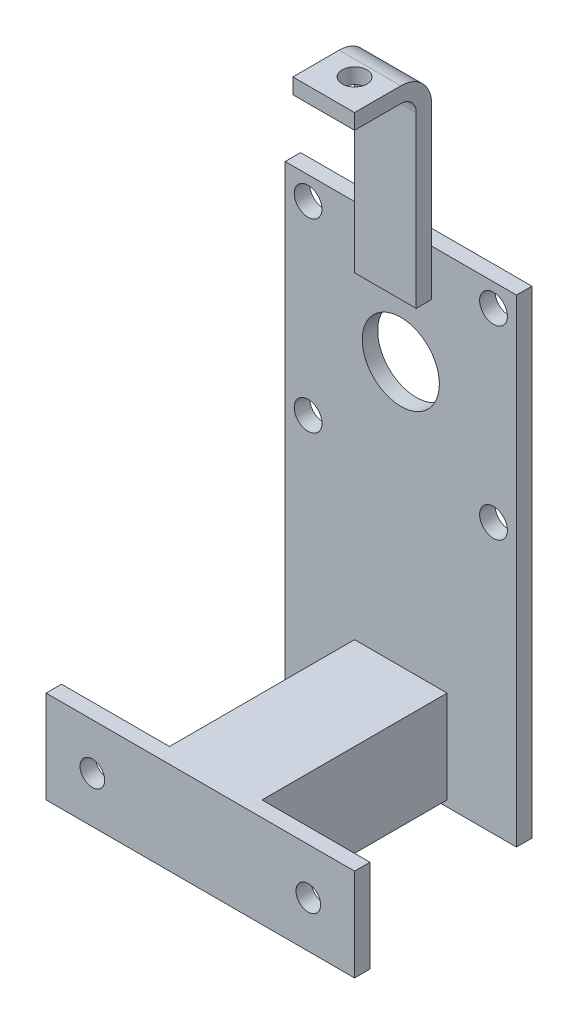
from build123d import *

# Parameters (mm, degrees)
ESQUISSE1_W                      = 75
ESQUISSE1_H                      = 155
EXTRUSION1_DEPTH                 = 5
ESQUISSE2_R                      = 12.5
ENL_V_MAT_EXTRU_1_DEPTH          = 173.26433177
ESQUISSE4_R                      = 4.5
ENL_V_MAT_EXTRU_3_DEPTH          = 173.26433177
R_P_TITION_CIRCULAIRE2_COUNT     = 4
ESQUISSE5_W                      = 20
ESQUISSE5_H                      = 65
EXTRUSION2_DEPTH                 = 5
ESQUISSE6_W                      = 20
ESQUISSE6_H                      = 5
EXTRUSION3_DEPTH                 = 20
CONG_1_R                         = 5
CONG_2_R                         = 10
TROU_TARAUD_M8X1_251_D           = 6.8
TROU_TARAUD_M8X1_251_DEPTH       = 22.25
TROU_TARAUD_M8X1_251_CBORE_D     = 8
TROU_TARAUD_M8X1_251_CBORE_DEPTH = 16
TROU_TARAUD_M8X1_251_TIP         = 2.042926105
ESQUISSE9_W                      = 30
ESQUISSE9_H                      = 30
ESQUISSE9_W_2                    = 26
ESQUISSE9_H_2                    = 26
EXTRUSION4_DEPTH                 = 60
ESQUISSE10_W                     = 100
ESQUISSE10_H                     = 30
EXTRUSION5_DEPTH                 = 5
TROU_TARAUD_M8X1_252_D           = 6.8
TROU_TARAUD_M8X1_252_DEPTH       = 22.25
TROU_TARAUD_M8X1_252_CBORE_D     = 8
TROU_TARAUD_M8X1_252_CBORE_DEPTH = 16
TROU_TARAUD_M8X1_252_TIP         = 2.042926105


with BuildPart() as part:
    # Esquisse1 → Extrusion1 (new body)
    with BuildSketch(Plane.XY):
        with Locations((37.5, 77.5)):
            Rectangle(ESQUISSE1_W, ESQUISSE1_H)
    extrude(amount=EXTRUSION1_DEPTH)

    # Esquisse2 → Enl_v. mat.-Extru.1 (cut, through all)
    with BuildSketch(Plane.XY.offset(5)):
        with Locations((37.5, 117.5)):
            Circle(ESQUISSE2_R)
    extrude(amount=-ENL_V_MAT_EXTRU_1_DEPTH, mode=Mode.SUBTRACT)

    # Esquisse4 → Enl_v. mat.-Extru.3 (cut, through all)
    with BuildSketch(Plane.XY.offset(5)):
        with Locations((67.5520382, 147.5520382)):
            Circle(ESQUISSE4_R)
    enl_v_mat_extru_3 = extrude(amount=-ENL_V_MAT_EXTRU_3_DEPTH, mode=Mode.SUBTRACT)

    # R_p_tition circulaire2: Enl_v. mat.-Extru.3 ×4 about axis
    r_p_tition_circulaire2_axis = Axis((37.5, 117.5, 5), (0, 0, -1))
    for i in range(1, R_P_TITION_CIRCULAIRE2_COUNT):
        add(enl_v_mat_extru_3.rotate(r_p_tition_circulaire2_axis, i * 360 / R_P_TITION_CIRCULAIRE2_COUNT), mode=Mode.SUBTRACT)

    # Esquisse5 → Extrusion2 (add)
    with BuildSketch(Plane.XY.offset(5)):
        with Locations((37.5, 172.5)):
            Rectangle(ESQUISSE5_W, ESQUISSE5_H)
    extrude(amount=EXTRUSION2_DEPTH)

    # Esquisse6 → Extrusion3 (add)
    with BuildSketch(Plane.XY.offset(10)):
        with Locations((37.5, 202.5)):
            Rectangle(ESQUISSE6_W, ESQUISSE6_H)
    extrude(amount=EXTRUSION3_DEPTH)

    # Cong_1
    cong_1_edges = [part.edges().sort_by_distance(p)[0] for p in [
        (37.5, 200, 10),
    ]]
    fillet(cong_1_edges, radius=CONG_1_R)

    # Cong_2
    cong_2_edges = [part.edges().sort_by_distance(p)[0] for p in [
        (37.5, 205, 5),
    ]]
    fillet(cong_2_edges, radius=CONG_2_R)

    # Trou taraud_ M8x1.251
    with Locations(Plane(origin=(0, 205, 0), x_dir=(-1, 0, 0), z_dir=(0, 1, 0))):
        with Locations((-37.5, 20)):
            CounterBoreHole(TROU_TARAUD_M8X1_251_D / 2, TROU_TARAUD_M8X1_251_CBORE_D / 2, TROU_TARAUD_M8X1_251_CBORE_DEPTH, depth=TROU_TARAUD_M8X1_251_DEPTH)
            with Locations((0, 0, -(TROU_TARAUD_M8X1_251_DEPTH + TROU_TARAUD_M8X1_251_TIP / 2))):  # 118° drill point
                Cone(0, TROU_TARAUD_M8X1_251_D / 2, TROU_TARAUD_M8X1_251_TIP, mode=Mode.SUBTRACT)

    # Esquisse9 → Extrusion4 (add)
    with BuildSketch(Plane.XY.offset(5)):
        with Locations((37.5, 17)):
            Rectangle(ESQUISSE9_W, ESQUISSE9_H)
        with Locations((37.5, 17)):
            Rectangle(ESQUISSE9_W_2, ESQUISSE9_H_2, mode=Mode.SUBTRACT)
    extrude(amount=EXTRUSION4_DEPTH)

    # Esquisse10 → Extrusion5 (add)
    with BuildSketch(Plane.XY.offset(65)):
        with Locations((37.5, 17)):
            Rectangle(ESQUISSE10_W, ESQUISSE10_H)
    extrude(amount=EXTRUSION5_DEPTH)

    # Trou taraud_ M8x1.252
    with Locations(Plane.XY.offset(70)):
        with Locations((2.5, 17), (72.5, 17)):
            CounterBoreHole(TROU_TARAUD_M8X1_252_D / 2, TROU_TARAUD_M8X1_252_CBORE_D / 2, TROU_TARAUD_M8X1_252_CBORE_DEPTH, depth=TROU_TARAUD_M8X1_252_DEPTH)
            with Locations((0, 0, -(TROU_TARAUD_M8X1_252_DEPTH + TROU_TARAUD_M8X1_252_TIP / 2))):  # 118° drill point
                Cone(0, TROU_TARAUD_M8X1_252_D / 2, TROU_TARAUD_M8X1_252_TIP, mode=Mode.SUBTRACT)


solid = part.part
